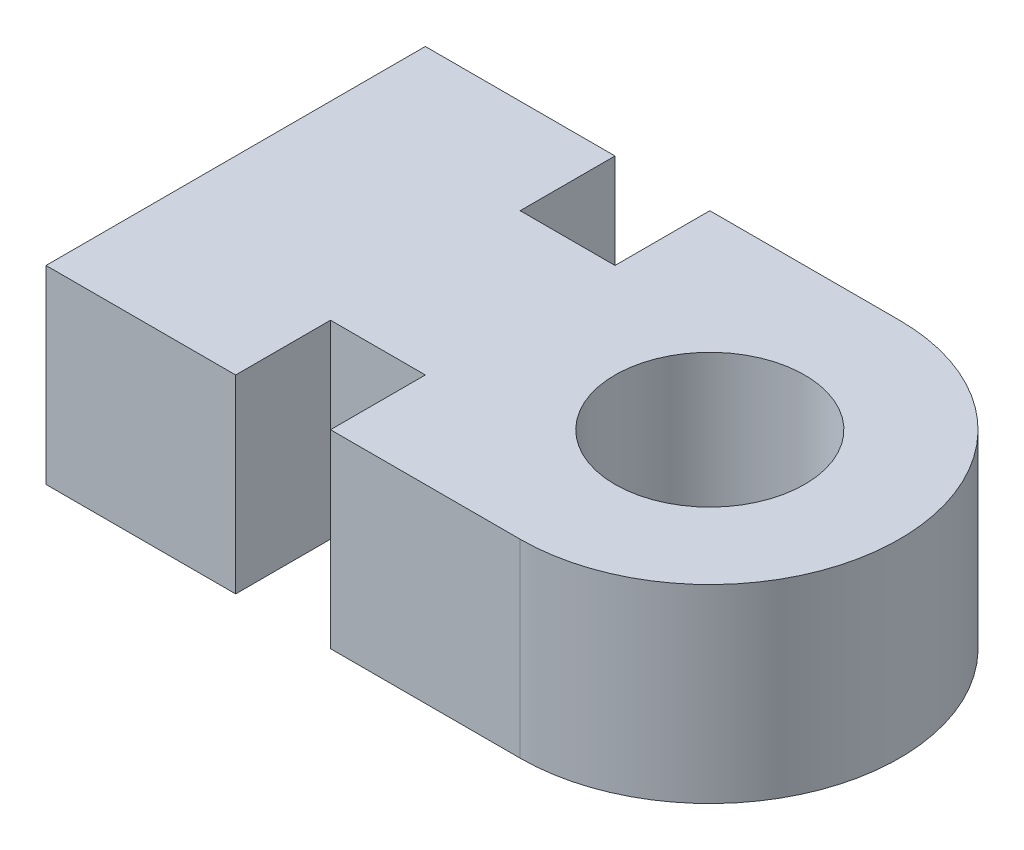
ISO-10303-21;
HEADER;
FILE_DESCRIPTION(('STEP AP214'),'2;1');
FILE_NAME('part.step','',(''),(''),'','','');
FILE_SCHEMA(('AUTOMOTIVE_DESIGN { 1 0 10303 214 1 1 1 1 }'));
ENDSEC;
DATA;
#1=APPLICATION_CONTEXT('core data for automotive mechanical design processes');
#2=APPLICATION_PROTOCOL_DEFINITION('international standard','automotive_design',2000,#1);
#3=PRODUCT_CONTEXT('',#1,'mechanical');
#4=PRODUCT('Part','Part','',(#3));
#5=PRODUCT_RELATED_PRODUCT_CATEGORY('part','',(#4));
#6=PRODUCT_DEFINITION_FORMATION('','',#4);
#7=PRODUCT_DEFINITION_CONTEXT('part definition',#1,'design');
#8=PRODUCT_DEFINITION('design','',#6,#7);
#9=PRODUCT_DEFINITION_SHAPE('','',#8);
#10=(LENGTH_UNIT() NAMED_UNIT(*) SI_UNIT(.MILLI.,.METRE.));
#11=(NAMED_UNIT(*) PLANE_ANGLE_UNIT() SI_UNIT($,.RADIAN.));
#12=(NAMED_UNIT(*) SI_UNIT($,.STERADIAN.) SOLID_ANGLE_UNIT());
#13=UNCERTAINTY_MEASURE_WITH_UNIT(LENGTH_MEASURE(1.E-05),#10,'distance_accuracy_value','');
#14=(GEOMETRIC_REPRESENTATION_CONTEXT(3) GLOBAL_UNCERTAINTY_ASSIGNED_CONTEXT((#13)) GLOBAL_UNIT_ASSIGNED_CONTEXT((#10,
#11,#12)) REPRESENTATION_CONTEXT('',''));
#15=CARTESIAN_POINT('',(0.,0.,0.));
#16=DIRECTION('',(0.,0.,1.));
#17=DIRECTION('',(1.,0.,0.));
#18=AXIS2_PLACEMENT_3D('',#15,#16,#17);
#19=CARTESIAN_POINT('',(0.,10.,0.));
#20=DIRECTION('',(0.,1.,0.));
#21=DIRECTION('',(0.,0.,1.));
#22=AXIS2_PLACEMENT_3D('',#19,#20,#21);
#23=PLANE('',#22);
#24=DIRECTION('',(1.,0.,0.));
#25=VECTOR('',#24,1.);
#26=CARTESIAN_POINT('',(-30.,10.,20.));
#27=LINE('',#26,#25);
#28=CARTESIAN_POINT('',(-50.,10.,20.));
#29=VERTEX_POINT('',#28);
#30=CARTESIAN_POINT('',(-30.,10.,20.));
#31=VERTEX_POINT('',#30);
#32=EDGE_CURVE('E174',#29,#31,#27,.T.);
#33=ORIENTED_EDGE('',*,*,#32,.T.);
#34=DIRECTION('',(0.,0.,-1.));
#35=VECTOR('',#34,1.);
#36=CARTESIAN_POINT('',(-30.,10.,10.));
#37=LINE('',#36,#35);
#38=CARTESIAN_POINT('',(-30.,10.,10.));
#39=VERTEX_POINT('',#38);
#40=EDGE_CURVE('E102',#31,#39,#37,.T.);
#41=ORIENTED_EDGE('',*,*,#40,.T.);
#42=DIRECTION('',(1.,0.,0.));
#43=VECTOR('',#42,1.);
#44=CARTESIAN_POINT('',(-20.,10.,10.));
#45=LINE('',#44,#43);
#46=CARTESIAN_POINT('',(-20.,10.,10.));
#47=VERTEX_POINT('',#46);
#48=EDGE_CURVE('E201',#39,#47,#45,.T.);
#49=ORIENTED_EDGE('',*,*,#48,.T.);
#50=DIRECTION('',(0.,0.,1.));
#51=VECTOR('',#50,1.);
#52=CARTESIAN_POINT('',(-20.,10.,20.));
#53=LINE('',#52,#51);
#54=CARTESIAN_POINT('',(-20.,10.,20.));
#55=VERTEX_POINT('',#54);
#56=EDGE_CURVE('E220',#47,#55,#53,.T.);
#57=ORIENTED_EDGE('',*,*,#56,.T.);
#58=DIRECTION('',(1.,0.,0.));
#59=VECTOR('',#58,1.);
#60=CARTESIAN_POINT('',(0.,10.,20.));
#61=LINE('',#60,#59);
#62=CARTESIAN_POINT('',(0.,10.,20.));
#63=VERTEX_POINT('',#62);
#64=EDGE_CURVE('E217',#55,#63,#61,.T.);
#65=ORIENTED_EDGE('',*,*,#64,.T.);
#66=CARTESIAN_POINT('',(0.,10.,0.));
#67=DIRECTION('',(0.,1.,0.));
#68=DIRECTION('',(0.,0.,1.));
#69=AXIS2_PLACEMENT_3D('',#66,#67,#68);
#70=CIRCLE('',#69,20.);
#71=CARTESIAN_POINT('',(0.,10.,-20.));
#72=VERTEX_POINT('',#71);
#73=EDGE_CURVE('E219',#63,#72,#70,.T.);
#74=ORIENTED_EDGE('',*,*,#73,.T.);
#75=DIRECTION('',(-1.,0.,0.));
#76=VECTOR('',#75,1.);
#77=CARTESIAN_POINT('',(0.,10.,-20.));
#78=LINE('',#77,#76);
#79=CARTESIAN_POINT('',(-20.,10.,-20.));
#80=VERTEX_POINT('',#79);
#81=EDGE_CURVE('E222',#72,#80,#78,.T.);
#82=ORIENTED_EDGE('',*,*,#81,.T.);
#83=DIRECTION('',(0.,0.,1.));
#84=VECTOR('',#83,1.);
#85=CARTESIAN_POINT('',(-20.,10.,-20.));
#86=LINE('',#85,#84);
#87=CARTESIAN_POINT('',(-20.,10.,-10.));
#88=VERTEX_POINT('',#87);
#89=EDGE_CURVE('E228',#80,#88,#86,.T.);
#90=ORIENTED_EDGE('',*,*,#89,.T.);
#91=DIRECTION('',(-1.,0.,0.));
#92=VECTOR('',#91,1.);
#93=CARTESIAN_POINT('',(-20.,10.,-10.));
#94=LINE('',#93,#92);
#95=CARTESIAN_POINT('',(-30.,10.,-10.));
#96=VERTEX_POINT('',#95);
#97=EDGE_CURVE('E133',#88,#96,#94,.T.);
#98=ORIENTED_EDGE('',*,*,#97,.T.);
#99=DIRECTION('',(0.,0.,-1.));
#100=VECTOR('',#99,1.);
#101=CARTESIAN_POINT('',(-30.,10.,-10.));
#102=LINE('',#101,#100);
#103=CARTESIAN_POINT('',(-30.,10.,-20.));
#104=VERTEX_POINT('',#103);
#105=EDGE_CURVE('E127',#96,#104,#102,.T.);
#106=ORIENTED_EDGE('',*,*,#105,.T.);
#107=DIRECTION('',(-1.,0.,0.));
#108=VECTOR('',#107,1.);
#109=CARTESIAN_POINT('',(-30.,10.,-20.));
#110=LINE('',#109,#108);
#111=CARTESIAN_POINT('',(-50.,10.,-20.));
#112=VERTEX_POINT('',#111);
#113=EDGE_CURVE('E131',#104,#112,#110,.T.);
#114=ORIENTED_EDGE('',*,*,#113,.T.);
#115=DIRECTION('',(0.,0.,1.));
#116=VECTOR('',#115,1.);
#117=CARTESIAN_POINT('',(-50.,10.,-20.));
#118=LINE('',#117,#116);
#119=EDGE_CURVE('E47',#112,#29,#118,.T.);
#120=ORIENTED_EDGE('',*,*,#119,.T.);
#121=EDGE_LOOP('',(#33,#41,#49,#57,#65,#74,#82,#90,#98,#106,#114,#120));
#122=FACE_BOUND('',#121,.T.);
#123=CARTESIAN_POINT('',(0.,10.,0.));
#124=DIRECTION('',(0.,1.,0.));
#125=DIRECTION('',(0.,0.,1.));
#126=AXIS2_PLACEMENT_3D('',#123,#124,#125);
#127=CIRCLE('',#126,10.);
#128=CARTESIAN_POINT('',(0.,10.,10.));
#129=VERTEX_POINT('',#128);
#130=EDGE_CURVE('E155',#129,#129,#127,.T.);
#131=ORIENTED_EDGE('',*,*,#130,.F.);
#132=EDGE_LOOP('',(#131));
#133=FACE_BOUND('',#132,.T.);
#134=ADVANCED_FACE('F30',(#122,#133),#23,.T.);
#135=CARTESIAN_POINT('',(0.,-10.,0.));
#136=DIRECTION('',(0.,1.,0.));
#137=DIRECTION('',(0.,0.,1.));
#138=AXIS2_PLACEMENT_3D('',#135,#136,#137);
#139=PLANE('',#138);
#140=DIRECTION('',(1.,0.,0.));
#141=VECTOR('',#140,1.);
#142=CARTESIAN_POINT('',(-30.,-10.,20.));
#143=LINE('',#142,#141);
#144=CARTESIAN_POINT('',(-50.,-10.,20.));
#145=VERTEX_POINT('',#144);
#146=CARTESIAN_POINT('',(-30.,-10.,20.));
#147=VERTEX_POINT('',#146);
#148=EDGE_CURVE('E151',#145,#147,#143,.T.);
#149=ORIENTED_EDGE('',*,*,#148,.F.);
#150=DIRECTION('',(0.,0.,1.));
#151=VECTOR('',#150,1.);
#152=CARTESIAN_POINT('',(-50.,-10.,-20.));
#153=LINE('',#152,#151);
#154=CARTESIAN_POINT('',(-50.,-10.,-20.));
#155=VERTEX_POINT('',#154);
#156=EDGE_CURVE('E94',#155,#145,#153,.T.);
#157=ORIENTED_EDGE('',*,*,#156,.F.);
#158=DIRECTION('',(-1.,0.,0.));
#159=VECTOR('',#158,1.);
#160=CARTESIAN_POINT('',(-30.,-10.,-20.));
#161=LINE('',#160,#159);
#162=CARTESIAN_POINT('',(-30.,-10.,-20.));
#163=VERTEX_POINT('',#162);
#164=EDGE_CURVE('E88',#163,#155,#161,.T.);
#165=ORIENTED_EDGE('',*,*,#164,.F.);
#166=DIRECTION('',(0.,0.,-1.));
#167=VECTOR('',#166,1.);
#168=CARTESIAN_POINT('',(-30.,-10.,-10.));
#169=LINE('',#168,#167);
#170=CARTESIAN_POINT('',(-30.,-10.,-10.));
#171=VERTEX_POINT('',#170);
#172=EDGE_CURVE('E141',#171,#163,#169,.T.);
#173=ORIENTED_EDGE('',*,*,#172,.F.);
#174=DIRECTION('',(-1.,0.,0.));
#175=VECTOR('',#174,1.);
#176=CARTESIAN_POINT('',(-20.,-10.,-10.));
#177=LINE('',#176,#175);
#178=CARTESIAN_POINT('',(-20.,-10.,-10.));
#179=VERTEX_POINT('',#178);
#180=EDGE_CURVE('E169',#179,#171,#177,.T.);
#181=ORIENTED_EDGE('',*,*,#180,.F.);
#182=DIRECTION('',(0.,0.,1.));
#183=VECTOR('',#182,1.);
#184=CARTESIAN_POINT('',(-20.,-10.,-20.));
#185=LINE('',#184,#183);
#186=CARTESIAN_POINT('',(-20.,-10.,-20.));
#187=VERTEX_POINT('',#186);
#188=EDGE_CURVE('E167',#187,#179,#185,.T.);
#189=ORIENTED_EDGE('',*,*,#188,.F.);
#190=DIRECTION('',(-1.,0.,0.));
#191=VECTOR('',#190,1.);
#192=CARTESIAN_POINT('',(0.,-10.,-20.));
#193=LINE('',#192,#191);
#194=CARTESIAN_POINT('',(0.,-10.,-20.));
#195=VERTEX_POINT('',#194);
#196=EDGE_CURVE('E165',#195,#187,#193,.T.);
#197=ORIENTED_EDGE('',*,*,#196,.F.);
#198=CARTESIAN_POINT('',(0.,-10.,0.));
#199=DIRECTION('',(0.,1.,0.));
#200=DIRECTION('',(0.,0.,1.));
#201=AXIS2_PLACEMENT_3D('',#198,#199,#200);
#202=CIRCLE('',#201,20.);
#203=CARTESIAN_POINT('',(0.,-10.,20.));
#204=VERTEX_POINT('',#203);
#205=EDGE_CURVE('E163',#204,#195,#202,.T.);
#206=ORIENTED_EDGE('',*,*,#205,.F.);
#207=DIRECTION('',(1.,0.,0.));
#208=VECTOR('',#207,1.);
#209=CARTESIAN_POINT('',(0.,-10.,20.));
#210=LINE('',#209,#208);
#211=CARTESIAN_POINT('',(-20.,-10.,20.));
#212=VERTEX_POINT('',#211);
#213=EDGE_CURVE('E161',#212,#204,#210,.T.);
#214=ORIENTED_EDGE('',*,*,#213,.F.);
#215=DIRECTION('',(0.,0.,1.));
#216=VECTOR('',#215,1.);
#217=CARTESIAN_POINT('',(-20.,-10.,20.));
#218=LINE('',#217,#216);
#219=CARTESIAN_POINT('',(-20.,-10.,10.));
#220=VERTEX_POINT('',#219);
#221=EDGE_CURVE('E159',#220,#212,#218,.T.);
#222=ORIENTED_EDGE('',*,*,#221,.F.);
#223=DIRECTION('',(1.,0.,0.));
#224=VECTOR('',#223,1.);
#225=CARTESIAN_POINT('',(-20.,-10.,10.));
#226=LINE('',#225,#224);
#227=CARTESIAN_POINT('',(-30.,-10.,10.));
#228=VERTEX_POINT('',#227);
#229=EDGE_CURVE('E157',#228,#220,#226,.T.);
#230=ORIENTED_EDGE('',*,*,#229,.F.);
#231=DIRECTION('',(0.,0.,-1.));
#232=VECTOR('',#231,1.);
#233=CARTESIAN_POINT('',(-30.,-10.,10.));
#234=LINE('',#233,#232);
#235=EDGE_CURVE('E154',#147,#228,#234,.T.);
#236=ORIENTED_EDGE('',*,*,#235,.F.);
#237=EDGE_LOOP('',(#149,#157,#165,#173,#181,#189,#197,#206,#214,#222,#230,#236));
#238=FACE_BOUND('',#237,.T.);
#239=CARTESIAN_POINT('',(0.,-10.,0.));
#240=DIRECTION('',(0.,1.,0.));
#241=DIRECTION('',(0.,0.,1.));
#242=AXIS2_PLACEMENT_3D('',#239,#240,#241);
#243=CIRCLE('',#242,10.);
#244=CARTESIAN_POINT('',(0.,-10.,10.));
#245=VERTEX_POINT('',#244);
#246=EDGE_CURVE('E375',#245,#245,#243,.T.);
#247=ORIENTED_EDGE('',*,*,#246,.T.);
#248=EDGE_LOOP('',(#247));
#249=FACE_BOUND('',#248,.T.);
#250=ADVANCED_FACE('F205',(#238,#249),#139,.F.);
#251=CARTESIAN_POINT('',(-30.,10.,20.));
#252=DIRECTION('',(0.,0.,-1.));
#253=DIRECTION('',(-1.,0.,0.));
#254=AXIS2_PLACEMENT_3D('',#251,#252,#253);
#255=PLANE('',#254);
#256=ORIENTED_EDGE('',*,*,#148,.T.);
#257=DIRECTION('',(0.,-1.,0.));
#258=VECTOR('',#257,1.);
#259=CARTESIAN_POINT('',(-30.,10.,20.));
#260=LINE('',#259,#258);
#261=EDGE_CURVE('E11',#31,#147,#260,.T.);
#262=ORIENTED_EDGE('',*,*,#261,.F.);
#263=ORIENTED_EDGE('',*,*,#32,.F.);
#264=DIRECTION('',(0.,-1.,0.));
#265=VECTOR('',#264,1.);
#266=CARTESIAN_POINT('',(-50.,10.,20.));
#267=LINE('',#266,#265);
#268=EDGE_CURVE('E147',#29,#145,#267,.T.);
#269=ORIENTED_EDGE('',*,*,#268,.T.);
#270=EDGE_LOOP('',(#256,#262,#263,#269));
#271=FACE_BOUND('',#270,.T.);
#272=ADVANCED_FACE('F32',(#271),#255,.F.);
#273=CARTESIAN_POINT('',(-30.,10.,10.));
#274=DIRECTION('',(-1.,0.,0.));
#275=DIRECTION('',(0.,0.,1.));
#276=AXIS2_PLACEMENT_3D('',#273,#274,#275);
#277=PLANE('',#276);
#278=ORIENTED_EDGE('',*,*,#235,.T.);
#279=DIRECTION('',(0.,-1.,0.));
#280=VECTOR('',#279,1.);
#281=CARTESIAN_POINT('',(-30.,10.,10.));
#282=LINE('',#281,#280);
#283=EDGE_CURVE('E39',#39,#228,#282,.T.);
#284=ORIENTED_EDGE('',*,*,#283,.F.);
#285=ORIENTED_EDGE('',*,*,#40,.F.);
#286=ORIENTED_EDGE('',*,*,#261,.T.);
#287=EDGE_LOOP('',(#278,#284,#285,#286));
#288=FACE_BOUND('',#287,.T.);
#289=ADVANCED_FACE('F262',(#288),#277,.F.);
#290=CARTESIAN_POINT('',(-20.,10.,10.));
#291=DIRECTION('',(0.,0.,-1.));
#292=DIRECTION('',(-1.,0.,0.));
#293=AXIS2_PLACEMENT_3D('',#290,#291,#292);
#294=PLANE('',#293);
#295=ORIENTED_EDGE('',*,*,#229,.T.);
#296=DIRECTION('',(0.,-1.,0.));
#297=VECTOR('',#296,1.);
#298=CARTESIAN_POINT('',(-20.,10.,10.));
#299=LINE('',#298,#297);
#300=EDGE_CURVE('E193',#47,#220,#299,.T.);
#301=ORIENTED_EDGE('',*,*,#300,.F.);
#302=ORIENTED_EDGE('',*,*,#48,.F.);
#303=ORIENTED_EDGE('',*,*,#283,.T.);
#304=EDGE_LOOP('',(#295,#301,#302,#303));
#305=FACE_BOUND('',#304,.T.);
#306=ADVANCED_FACE('F199',(#305),#294,.F.);
#307=CARTESIAN_POINT('',(-20.,10.,20.));
#308=DIRECTION('',(1.,0.,0.));
#309=DIRECTION('',(0.,0.,-1.));
#310=AXIS2_PLACEMENT_3D('',#307,#308,#309);
#311=PLANE('',#310);
#312=ORIENTED_EDGE('',*,*,#221,.T.);
#313=DIRECTION('',(0.,-1.,0.));
#314=VECTOR('',#313,1.);
#315=CARTESIAN_POINT('',(-20.,10.,20.));
#316=LINE('',#315,#314);
#317=EDGE_CURVE('E190',#55,#212,#316,.T.);
#318=ORIENTED_EDGE('',*,*,#317,.F.);
#319=ORIENTED_EDGE('',*,*,#56,.F.);
#320=ORIENTED_EDGE('',*,*,#300,.T.);
#321=EDGE_LOOP('',(#312,#318,#319,#320));
#322=FACE_BOUND('',#321,.T.);
#323=ADVANCED_FACE('F211',(#322),#311,.F.);
#324=CARTESIAN_POINT('',(0.,10.,20.));
#325=DIRECTION('',(0.,0.,-1.));
#326=DIRECTION('',(-1.,0.,0.));
#327=AXIS2_PLACEMENT_3D('',#324,#325,#326);
#328=PLANE('',#327);
#329=ORIENTED_EDGE('',*,*,#213,.T.);
#330=DIRECTION('',(0.,-1.,0.));
#331=VECTOR('',#330,1.);
#332=CARTESIAN_POINT('',(0.,10.,20.));
#333=LINE('',#332,#331);
#334=EDGE_CURVE('E187',#63,#204,#333,.T.);
#335=ORIENTED_EDGE('',*,*,#334,.F.);
#336=ORIENTED_EDGE('',*,*,#64,.F.);
#337=ORIENTED_EDGE('',*,*,#317,.T.);
#338=EDGE_LOOP('',(#329,#335,#336,#337));
#339=FACE_BOUND('',#338,.T.);
#340=ADVANCED_FACE('F215',(#339),#328,.F.);
#341=CARTESIAN_POINT('',(0.,10.,0.));
#342=DIRECTION('',(0.,-1.,0.));
#343=DIRECTION('',(0.,0.,-1.));
#344=AXIS2_PLACEMENT_3D('',#341,#342,#343);
#345=CYLINDRICAL_SURFACE('',#344,20.);
#346=ORIENTED_EDGE('',*,*,#205,.T.);
#347=DIRECTION('',(0.,-1.,0.));
#348=VECTOR('',#347,1.);
#349=CARTESIAN_POINT('',(0.,10.,-20.));
#350=LINE('',#349,#348);
#351=EDGE_CURVE('E184',#72,#195,#350,.T.);
#352=ORIENTED_EDGE('',*,*,#351,.F.);
#353=ORIENTED_EDGE('',*,*,#73,.F.);
#354=ORIENTED_EDGE('',*,*,#334,.T.);
#355=EDGE_LOOP('',(#346,#352,#353,#354));
#356=FACE_BOUND('',#355,.T.);
#357=ADVANCED_FACE('F275',(#356),#345,.T.);
#358=CARTESIAN_POINT('',(0.,10.,-20.));
#359=DIRECTION('',(0.,0.,1.));
#360=DIRECTION('',(1.,0.,0.));
#361=AXIS2_PLACEMENT_3D('',#358,#359,#360);
#362=PLANE('',#361);
#363=ORIENTED_EDGE('',*,*,#196,.T.);
#364=DIRECTION('',(0.,-1.,0.));
#365=VECTOR('',#364,1.);
#366=CARTESIAN_POINT('',(-20.,10.,-20.));
#367=LINE('',#366,#365);
#368=EDGE_CURVE('E181',#80,#187,#367,.T.);
#369=ORIENTED_EDGE('',*,*,#368,.F.);
#370=ORIENTED_EDGE('',*,*,#81,.F.);
#371=ORIENTED_EDGE('',*,*,#351,.T.);
#372=EDGE_LOOP('',(#363,#369,#370,#371));
#373=FACE_BOUND('',#372,.T.);
#374=ADVANCED_FACE('F278',(#373),#362,.F.);
#375=CARTESIAN_POINT('',(-20.,10.,-20.));
#376=DIRECTION('',(1.,0.,0.));
#377=DIRECTION('',(0.,0.,-1.));
#378=AXIS2_PLACEMENT_3D('',#375,#376,#377);
#379=PLANE('',#378);
#380=ORIENTED_EDGE('',*,*,#188,.T.);
#381=DIRECTION('',(0.,-1.,0.));
#382=VECTOR('',#381,1.);
#383=CARTESIAN_POINT('',(-20.,10.,-10.));
#384=LINE('',#383,#382);
#385=EDGE_CURVE('E178',#88,#179,#384,.T.);
#386=ORIENTED_EDGE('',*,*,#385,.F.);
#387=ORIENTED_EDGE('',*,*,#89,.F.);
#388=ORIENTED_EDGE('',*,*,#368,.T.);
#389=EDGE_LOOP('',(#380,#386,#387,#388));
#390=FACE_BOUND('',#389,.T.);
#391=ADVANCED_FACE('F234',(#390),#379,.F.);
#392=CARTESIAN_POINT('',(-20.,10.,-10.));
#393=DIRECTION('',(0.,0.,1.));
#394=DIRECTION('',(1.,0.,0.));
#395=AXIS2_PLACEMENT_3D('',#392,#393,#394);
#396=PLANE('',#395);
#397=ORIENTED_EDGE('',*,*,#180,.T.);
#398=DIRECTION('',(0.,-1.,0.));
#399=VECTOR('',#398,1.);
#400=CARTESIAN_POINT('',(-30.,10.,-10.));
#401=LINE('',#400,#399);
#402=EDGE_CURVE('E142',#96,#171,#401,.T.);
#403=ORIENTED_EDGE('',*,*,#402,.F.);
#404=ORIENTED_EDGE('',*,*,#97,.F.);
#405=ORIENTED_EDGE('',*,*,#385,.T.);
#406=EDGE_LOOP('',(#397,#403,#404,#405));
#407=FACE_BOUND('',#406,.T.);
#408=ADVANCED_FACE('F238',(#407),#396,.F.);
#409=CARTESIAN_POINT('',(-30.,10.,-10.));
#410=DIRECTION('',(-1.,0.,0.));
#411=DIRECTION('',(0.,0.,1.));
#412=AXIS2_PLACEMENT_3D('',#409,#410,#411);
#413=PLANE('',#412);
#414=ORIENTED_EDGE('',*,*,#172,.T.);
#415=DIRECTION('',(0.,-1.,0.));
#416=VECTOR('',#415,1.);
#417=CARTESIAN_POINT('',(-30.,10.,-20.));
#418=LINE('',#417,#416);
#419=EDGE_CURVE('E138',#104,#163,#418,.T.);
#420=ORIENTED_EDGE('',*,*,#419,.F.);
#421=ORIENTED_EDGE('',*,*,#105,.F.);
#422=ORIENTED_EDGE('',*,*,#402,.T.);
#423=EDGE_LOOP('',(#414,#420,#421,#422));
#424=FACE_BOUND('',#423,.T.);
#425=ADVANCED_FACE('F139',(#424),#413,.F.);
#426=CARTESIAN_POINT('',(-30.,10.,-20.));
#427=DIRECTION('',(0.,0.,1.));
#428=DIRECTION('',(1.,0.,0.));
#429=AXIS2_PLACEMENT_3D('',#426,#427,#428);
#430=PLANE('',#429);
#431=ORIENTED_EDGE('',*,*,#164,.T.);
#432=DIRECTION('',(0.,-1.,0.));
#433=VECTOR('',#432,1.);
#434=CARTESIAN_POINT('',(-50.,10.,-20.));
#435=LINE('',#434,#433);
#436=EDGE_CURVE('E143',#112,#155,#435,.T.);
#437=ORIENTED_EDGE('',*,*,#436,.F.);
#438=ORIENTED_EDGE('',*,*,#113,.F.);
#439=ORIENTED_EDGE('',*,*,#419,.T.);
#440=EDGE_LOOP('',(#431,#437,#438,#439));
#441=FACE_BOUND('',#440,.T.);
#442=ADVANCED_FACE('F145',(#441),#430,.F.);
#443=CARTESIAN_POINT('',(-50.,10.,-20.));
#444=DIRECTION('',(1.,0.,0.));
#445=DIRECTION('',(0.,0.,-1.));
#446=AXIS2_PLACEMENT_3D('',#443,#444,#445);
#447=PLANE('',#446);
#448=ORIENTED_EDGE('',*,*,#156,.T.);
#449=ORIENTED_EDGE('',*,*,#268,.F.);
#450=ORIENTED_EDGE('',*,*,#119,.F.);
#451=ORIENTED_EDGE('',*,*,#436,.T.);
#452=EDGE_LOOP('',(#448,#449,#450,#451));
#453=FACE_BOUND('',#452,.T.);
#454=ADVANCED_FACE('F242',(#453),#447,.F.);
#455=CARTESIAN_POINT('',(0.,10.,0.));
#456=DIRECTION('',(0.,-1.,0.));
#457=DIRECTION('',(0.,0.,-1.));
#458=AXIS2_PLACEMENT_3D('',#455,#456,#457);
#459=CYLINDRICAL_SURFACE('',#458,10.);
#460=ORIENTED_EDGE('',*,*,#130,.T.);
#461=EDGE_LOOP('',(#460));
#462=FACE_BOUND('',#461,.T.);
#463=ORIENTED_EDGE('',*,*,#246,.F.);
#464=EDGE_LOOP('',(#463));
#465=FACE_BOUND('',#464,.T.);
#466=ADVANCED_FACE('F244',(#462,#465),#459,.F.);
#467=CLOSED_SHELL('',(#134,#250,#272,#289,#306,#323,#340,#357,#374,#391,#408,#425,#442,#454,#466));
#468=MANIFOLD_SOLID_BREP('B2',#467);
#469=ADVANCED_BREP_SHAPE_REPRESENTATION('',(#18,#468),#14);
#470=SHAPE_DEFINITION_REPRESENTATION(#9,#469);
ENDSEC;
END-ISO-10303-21;
